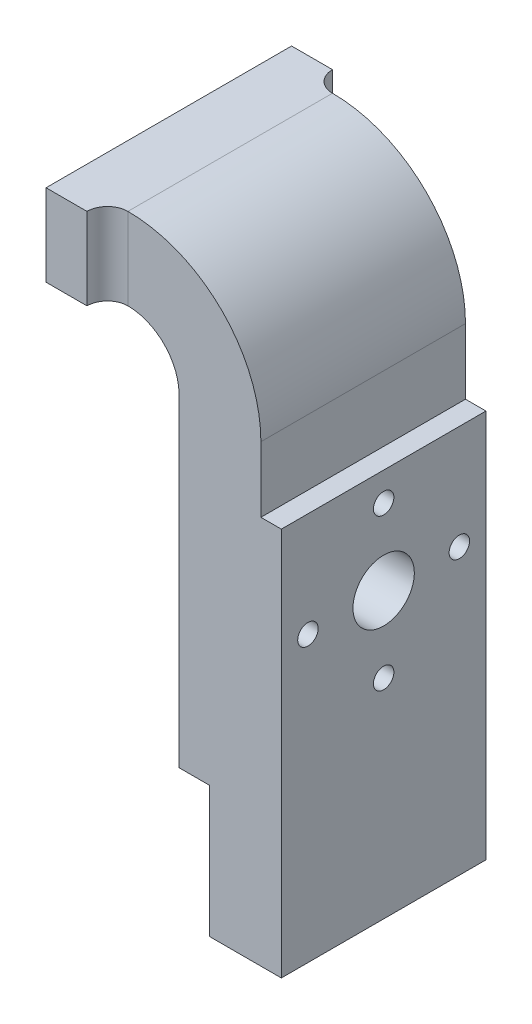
ISO-10303-21;
HEADER;
FILE_DESCRIPTION(('STEP AP214'),'2;1');
FILE_NAME('part.step','',(''),(''),'','','');
FILE_SCHEMA(('AUTOMOTIVE_DESIGN { 1 0 10303 214 1 1 1 1 }'));
ENDSEC;
DATA;
#1=APPLICATION_CONTEXT('core data for automotive mechanical design processes');
#2=APPLICATION_PROTOCOL_DEFINITION('international standard','automotive_design',2000,#1);
#3=PRODUCT_CONTEXT('',#1,'mechanical');
#4=PRODUCT('Part','Part','',(#3));
#5=PRODUCT_RELATED_PRODUCT_CATEGORY('part','',(#4));
#6=PRODUCT_DEFINITION_FORMATION('','',#4);
#7=PRODUCT_DEFINITION_CONTEXT('part definition',#1,'design');
#8=PRODUCT_DEFINITION('design','',#6,#7);
#9=PRODUCT_DEFINITION_SHAPE('','',#8);
#10=(LENGTH_UNIT() NAMED_UNIT(*) SI_UNIT(.MILLI.,.METRE.));
#11=(NAMED_UNIT(*) PLANE_ANGLE_UNIT() SI_UNIT($,.RADIAN.));
#12=(NAMED_UNIT(*) SI_UNIT($,.STERADIAN.) SOLID_ANGLE_UNIT());
#13=UNCERTAINTY_MEASURE_WITH_UNIT(LENGTH_MEASURE(1.E-05),#10,'distance_accuracy_value','');
#14=(GEOMETRIC_REPRESENTATION_CONTEXT(3) GLOBAL_UNCERTAINTY_ASSIGNED_CONTEXT((#13)) GLOBAL_UNIT_ASSIGNED_CONTEXT((#10,
#11,#12)) REPRESENTATION_CONTEXT('',''));
#15=CARTESIAN_POINT('',(0.,0.,0.));
#16=DIRECTION('',(0.,0.,1.));
#17=DIRECTION('',(1.,0.,0.));
#18=AXIS2_PLACEMENT_3D('',#15,#16,#17);
#19=CARTESIAN_POINT('',(107.5,222.,50.));
#20=DIRECTION('',(0.,0.,-1.));
#21=DIRECTION('',(-1.,0.,0.));
#22=AXIS2_PLACEMENT_3D('',#19,#20,#21);
#23=CYLINDRICAL_SURFACE('',#22,25.);
#24=CARTESIAN_POINT('',(107.5,222.,-50.));
#25=DIRECTION('',(0.,0.,-1.));
#26=DIRECTION('',(1.,0.,0.));
#27=AXIS2_PLACEMENT_3D('',#24,#25,#26);
#28=CIRCLE('',#27,25.);
#29=CARTESIAN_POINT('',(107.5,247.,-50.));
#30=VERTEX_POINT('',#29);
#31=CARTESIAN_POINT('',(132.5,222.,-50.));
#32=VERTEX_POINT('',#31);
#33=EDGE_CURVE('E160',#30,#32,#28,.T.);
#34=ORIENTED_EDGE('',*,*,#33,.T.);
#35=DIRECTION('',(0.,0.,-1.));
#36=VECTOR('',#35,1.);
#37=CARTESIAN_POINT('',(132.5,222.,50.));
#38=LINE('',#37,#36);
#39=CARTESIAN_POINT('',(132.5,222.,50.));
#40=VERTEX_POINT('',#39);
#41=EDGE_CURVE('E202',#40,#32,#38,.T.);
#42=ORIENTED_EDGE('',*,*,#41,.F.);
#43=CARTESIAN_POINT('',(107.5,222.,50.));
#44=DIRECTION('',(0.,0.,-1.));
#45=DIRECTION('',(1.,0.,0.));
#46=AXIS2_PLACEMENT_3D('',#43,#44,#45);
#47=CIRCLE('',#46,25.);
#48=CARTESIAN_POINT('',(107.5,247.,50.));
#49=VERTEX_POINT('',#48);
#50=EDGE_CURVE('E178',#49,#40,#47,.T.);
#51=ORIENTED_EDGE('',*,*,#50,.F.);
#52=DIRECTION('',(0.,0.,-1.));
#53=VECTOR('',#52,1.);
#54=CARTESIAN_POINT('',(107.5,247.,50.));
#55=LINE('',#54,#53);
#56=EDGE_CURVE('E154',#49,#30,#55,.T.);
#57=ORIENTED_EDGE('',*,*,#56,.T.);
#58=EDGE_LOOP('',(#34,#42,#51,#57));
#59=FACE_BOUND('',#58,.T.);
#60=ADVANCED_FACE('F38',(#59),#23,.F.);
#61=CARTESIAN_POINT('',(132.5,222.,50.));
#62=DIRECTION('',(1.,0.,0.));
#63=DIRECTION('',(0.,0.,-1.));
#64=AXIS2_PLACEMENT_3D('',#61,#62,#63);
#65=PLANE('',#64);
#66=CARTESIAN_POINT('',(132.5,139.,-37.));
#67=DIRECTION('',(1.,0.,0.));
#68=DIRECTION('',(0.,0.,-1.));
#69=AXIS2_PLACEMENT_3D('',#66,#67,#68);
#70=CIRCLE('',#69,5.);
#71=CARTESIAN_POINT('',(132.5,144.,-37.));
#72=VERTEX_POINT('',#71);
#73=EDGE_CURVE('E499',#72,#72,#70,.T.);
#74=ORIENTED_EDGE('',*,*,#73,.T.);
#75=EDGE_LOOP('',(#74));
#76=FACE_BOUND('',#75,.T.);
#77=CARTESIAN_POINT('',(132.5,176.,0.));
#78=DIRECTION('',(1.,0.,0.));
#79=DIRECTION('',(0.,0.,-1.));
#80=AXIS2_PLACEMENT_3D('',#77,#78,#79);
#81=CIRCLE('',#80,5.);
#82=CARTESIAN_POINT('',(132.5,181.,0.));
#83=VERTEX_POINT('',#82);
#84=EDGE_CURVE('E503',#83,#83,#81,.T.);
#85=ORIENTED_EDGE('',*,*,#84,.T.);
#86=EDGE_LOOP('',(#85));
#87=FACE_BOUND('',#86,.T.);
#88=CARTESIAN_POINT('',(132.5,139.,37.));
#89=DIRECTION('',(1.,0.,0.));
#90=DIRECTION('',(0.,0.,-1.));
#91=AXIS2_PLACEMENT_3D('',#88,#89,#90);
#92=CIRCLE('',#91,5.);
#93=CARTESIAN_POINT('',(132.5,144.,37.));
#94=VERTEX_POINT('',#93);
#95=EDGE_CURVE('E512',#94,#94,#92,.T.);
#96=ORIENTED_EDGE('',*,*,#95,.T.);
#97=EDGE_LOOP('',(#96));
#98=FACE_BOUND('',#97,.T.);
#99=CARTESIAN_POINT('',(132.5,102.,0.));
#100=DIRECTION('',(1.,0.,0.));
#101=DIRECTION('',(0.,0.,-1.));
#102=AXIS2_PLACEMENT_3D('',#99,#100,#101);
#103=CIRCLE('',#102,5.);
#104=CARTESIAN_POINT('',(132.5,107.,0.));
#105=VERTEX_POINT('',#104);
#106=EDGE_CURVE('E518',#105,#105,#103,.T.);
#107=ORIENTED_EDGE('',*,*,#106,.T.);
#108=EDGE_LOOP('',(#107));
#109=FACE_BOUND('',#108,.T.);
#110=CARTESIAN_POINT('',(132.5,139.,0.));
#111=DIRECTION('',(1.,0.,0.));
#112=DIRECTION('',(0.,0.,-1.));
#113=AXIS2_PLACEMENT_3D('',#110,#111,#112);
#114=CIRCLE('',#113,15.);
#115=CARTESIAN_POINT('',(132.5,139.,-15.));
#116=VERTEX_POINT('',#115);
#117=EDGE_CURVE('E524',#116,#116,#114,.T.);
#118=ORIENTED_EDGE('',*,*,#117,.T.);
#119=EDGE_LOOP('',(#118));
#120=FACE_BOUND('',#119,.T.);
#121=DIRECTION('',(0.,-1.,0.));
#122=VECTOR('',#121,1.);
#123=CARTESIAN_POINT('',(132.5,222.,-50.));
#124=LINE('',#123,#122);
#125=CARTESIAN_POINT('',(132.5,64.,-50.));
#126=VERTEX_POINT('',#125);
#127=EDGE_CURVE('E163',#32,#126,#124,.T.);
#128=ORIENTED_EDGE('',*,*,#127,.T.);
#129=DIRECTION('',(0.,0.,-1.));
#130=VECTOR('',#129,1.);
#131=CARTESIAN_POINT('',(132.5,64.,50.));
#132=LINE('',#131,#130);
#133=CARTESIAN_POINT('',(132.5,64.,50.));
#134=VERTEX_POINT('',#133);
#135=EDGE_CURVE('E199',#134,#126,#132,.T.);
#136=ORIENTED_EDGE('',*,*,#135,.F.);
#137=DIRECTION('',(0.,-1.,0.));
#138=VECTOR('',#137,1.);
#139=CARTESIAN_POINT('',(132.5,222.,50.));
#140=LINE('',#139,#138);
#141=EDGE_CURVE('E108',#40,#134,#140,.T.);
#142=ORIENTED_EDGE('',*,*,#141,.F.);
#143=ORIENTED_EDGE('',*,*,#41,.T.);
#144=EDGE_LOOP('',(#128,#136,#142,#143));
#145=FACE_BOUND('',#144,.T.);
#146=ADVANCED_FACE('F280',(#76,#87,#98,#109,#120,#145),#65,.F.);
#147=CARTESIAN_POINT('',(132.5,64.,50.));
#148=DIRECTION('',(0.,1.,0.));
#149=DIRECTION('',(0.,0.,1.));
#150=AXIS2_PLACEMENT_3D('',#147,#148,#149);
#151=PLANE('',#150);
#152=DIRECTION('',(1.,0.,0.));
#153=VECTOR('',#152,1.);
#154=CARTESIAN_POINT('',(132.5,64.,-50.));
#155=LINE('',#154,#153);
#156=CARTESIAN_POINT('',(147.5,64.,-50.));
#157=VERTEX_POINT('',#156);
#158=EDGE_CURVE('E166',#126,#157,#155,.T.);
#159=ORIENTED_EDGE('',*,*,#158,.T.);
#160=DIRECTION('',(0.,0.,-1.));
#161=VECTOR('',#160,1.);
#162=CARTESIAN_POINT('',(147.5,64.,50.));
#163=LINE('',#162,#161);
#164=CARTESIAN_POINT('',(147.5,64.,50.));
#165=VERTEX_POINT('',#164);
#166=EDGE_CURVE('E196',#165,#157,#163,.T.);
#167=ORIENTED_EDGE('',*,*,#166,.F.);
#168=DIRECTION('',(1.,0.,0.));
#169=VECTOR('',#168,1.);
#170=CARTESIAN_POINT('',(132.5,64.,50.));
#171=LINE('',#170,#169);
#172=EDGE_CURVE('E236',#134,#165,#171,.T.);
#173=ORIENTED_EDGE('',*,*,#172,.F.);
#174=ORIENTED_EDGE('',*,*,#135,.T.);
#175=EDGE_LOOP('',(#159,#167,#173,#174));
#176=FACE_BOUND('',#175,.T.);
#177=ADVANCED_FACE('F283',(#176),#151,.F.);
#178=CARTESIAN_POINT('',(147.5,64.,50.));
#179=DIRECTION('',(1.,0.,0.));
#180=DIRECTION('',(0.,1.,0.));
#181=AXIS2_PLACEMENT_3D('',#178,#179,#180);
#182=PLANE('',#181);
#183=DIRECTION('',(0.,-1.,0.));
#184=VECTOR('',#183,1.);
#185=CARTESIAN_POINT('',(147.5,64.,-50.));
#186=LINE('',#185,#184);
#187=CARTESIAN_POINT('',(147.5,0.,-50.));
#188=VERTEX_POINT('',#187);
#189=EDGE_CURVE('E168',#157,#188,#186,.T.);
#190=ORIENTED_EDGE('',*,*,#189,.T.);
#191=DIRECTION('',(0.,0.,-1.));
#192=VECTOR('',#191,1.);
#193=CARTESIAN_POINT('',(147.5,0.,50.));
#194=LINE('',#193,#192);
#195=CARTESIAN_POINT('',(147.5,0.,50.));
#196=VERTEX_POINT('',#195);
#197=EDGE_CURVE('E193',#196,#188,#194,.T.);
#198=ORIENTED_EDGE('',*,*,#197,.F.);
#199=DIRECTION('',(0.,-1.,0.));
#200=VECTOR('',#199,1.);
#201=CARTESIAN_POINT('',(147.5,64.,50.));
#202=LINE('',#201,#200);
#203=EDGE_CURVE('E238',#165,#196,#202,.T.);
#204=ORIENTED_EDGE('',*,*,#203,.F.);
#205=ORIENTED_EDGE('',*,*,#166,.T.);
#206=EDGE_LOOP('',(#190,#198,#204,#205));
#207=FACE_BOUND('',#206,.T.);
#208=ADVANCED_FACE('F288',(#207),#182,.F.);
#209=CARTESIAN_POINT('',(147.5,0.,50.));
#210=DIRECTION('',(0.,1.,0.));
#211=DIRECTION('',(0.,0.,1.));
#212=AXIS2_PLACEMENT_3D('',#209,#210,#211);
#213=PLANE('',#212);
#214=DIRECTION('',(1.,0.,0.));
#215=VECTOR('',#214,1.);
#216=CARTESIAN_POINT('',(147.5,0.,-50.));
#217=LINE('',#216,#215);
#218=CARTESIAN_POINT('',(182.5,0.,-50.));
#219=VERTEX_POINT('',#218);
#220=EDGE_CURVE('E170',#188,#219,#217,.T.);
#221=ORIENTED_EDGE('',*,*,#220,.T.);
#222=DIRECTION('',(0.,0.,-1.));
#223=VECTOR('',#222,1.);
#224=CARTESIAN_POINT('',(182.5,0.,50.));
#225=LINE('',#224,#223);
#226=CARTESIAN_POINT('',(182.5,0.,50.));
#227=VERTEX_POINT('',#226);
#228=EDGE_CURVE('E190',#227,#219,#225,.T.);
#229=ORIENTED_EDGE('',*,*,#228,.F.);
#230=DIRECTION('',(1.,0.,0.));
#231=VECTOR('',#230,1.);
#232=CARTESIAN_POINT('',(147.5,0.,50.));
#233=LINE('',#232,#231);
#234=EDGE_CURVE('E240',#196,#227,#233,.T.);
#235=ORIENTED_EDGE('',*,*,#234,.F.);
#236=ORIENTED_EDGE('',*,*,#197,.T.);
#237=EDGE_LOOP('',(#221,#229,#235,#236));
#238=FACE_BOUND('',#237,.T.);
#239=ADVANCED_FACE('F291',(#238),#213,.F.);
#240=CARTESIAN_POINT('',(182.5,190.,50.));
#241=DIRECTION('',(-1.,0.,0.));
#242=DIRECTION('',(0.,-1.,0.));
#243=AXIS2_PLACEMENT_3D('',#240,#241,#242);
#244=PLANE('',#243);
#245=CARTESIAN_POINT('',(182.5,139.,-37.));
#246=DIRECTION('',(1.,0.,0.));
#247=DIRECTION('',(0.,1.,0.));
#248=AXIS2_PLACEMENT_3D('',#245,#246,#247);
#249=CIRCLE('',#248,5.);
#250=CARTESIAN_POINT('',(182.5,144.,-37.));
#251=VERTEX_POINT('',#250);
#252=EDGE_CURVE('E496',#251,#251,#249,.T.);
#253=ORIENTED_EDGE('',*,*,#252,.F.);
#254=EDGE_LOOP('',(#253));
#255=FACE_BOUND('',#254,.T.);
#256=CARTESIAN_POINT('',(182.5,176.,0.));
#257=DIRECTION('',(1.,0.,0.));
#258=DIRECTION('',(0.,1.,0.));
#259=AXIS2_PLACEMENT_3D('',#256,#257,#258);
#260=CIRCLE('',#259,5.);
#261=CARTESIAN_POINT('',(182.5,181.,0.));
#262=VERTEX_POINT('',#261);
#263=EDGE_CURVE('E500',#262,#262,#260,.T.);
#264=ORIENTED_EDGE('',*,*,#263,.F.);
#265=EDGE_LOOP('',(#264));
#266=FACE_BOUND('',#265,.T.);
#267=CARTESIAN_POINT('',(182.5,139.,37.));
#268=DIRECTION('',(1.,0.,0.));
#269=DIRECTION('',(0.,1.,0.));
#270=AXIS2_PLACEMENT_3D('',#267,#268,#269);
#271=CIRCLE('',#270,5.);
#272=CARTESIAN_POINT('',(182.5,144.,37.));
#273=VERTEX_POINT('',#272);
#274=EDGE_CURVE('E509',#273,#273,#271,.T.);
#275=ORIENTED_EDGE('',*,*,#274,.F.);
#276=EDGE_LOOP('',(#275));
#277=FACE_BOUND('',#276,.T.);
#278=CARTESIAN_POINT('',(182.5,102.,0.));
#279=DIRECTION('',(1.,0.,0.));
#280=DIRECTION('',(0.,1.,0.));
#281=AXIS2_PLACEMENT_3D('',#278,#279,#280);
#282=CIRCLE('',#281,5.);
#283=CARTESIAN_POINT('',(182.5,107.,0.));
#284=VERTEX_POINT('',#283);
#285=EDGE_CURVE('E515',#284,#284,#282,.T.);
#286=ORIENTED_EDGE('',*,*,#285,.F.);
#287=EDGE_LOOP('',(#286));
#288=FACE_BOUND('',#287,.T.);
#289=CARTESIAN_POINT('',(182.5,139.,0.));
#290=DIRECTION('',(1.,0.,0.));
#291=DIRECTION('',(0.,1.,0.));
#292=AXIS2_PLACEMENT_3D('',#289,#290,#291);
#293=CIRCLE('',#292,15.);
#294=CARTESIAN_POINT('',(182.5,154.,0.));
#295=VERTEX_POINT('',#294);
#296=EDGE_CURVE('E521',#295,#295,#293,.T.);
#297=ORIENTED_EDGE('',*,*,#296,.F.);
#298=EDGE_LOOP('',(#297));
#299=FACE_BOUND('',#298,.T.);
#300=DIRECTION('',(0.,1.,0.));
#301=VECTOR('',#300,1.);
#302=CARTESIAN_POINT('',(182.5,190.,-50.));
#303=LINE('',#302,#301);
#304=CARTESIAN_POINT('',(182.5,190.,-50.));
#305=VERTEX_POINT('',#304);
#306=EDGE_CURVE('E172',#219,#305,#303,.T.);
#307=ORIENTED_EDGE('',*,*,#306,.T.);
#308=DIRECTION('',(0.,0.,-1.));
#309=VECTOR('',#308,1.);
#310=CARTESIAN_POINT('',(182.5,190.,50.));
#311=LINE('',#310,#309);
#312=CARTESIAN_POINT('',(182.5,190.,50.));
#313=VERTEX_POINT('',#312);
#314=EDGE_CURVE('E187',#313,#305,#311,.T.);
#315=ORIENTED_EDGE('',*,*,#314,.F.);
#316=DIRECTION('',(0.,1.,0.));
#317=VECTOR('',#316,1.);
#318=CARTESIAN_POINT('',(182.5,190.,50.));
#319=LINE('',#318,#317);
#320=EDGE_CURVE('E242',#227,#313,#319,.T.);
#321=ORIENTED_EDGE('',*,*,#320,.F.);
#322=ORIENTED_EDGE('',*,*,#228,.T.);
#323=EDGE_LOOP('',(#307,#315,#321,#322));
#324=FACE_BOUND('',#323,.T.);
#325=ADVANCED_FACE('F248',(#255,#266,#277,#288,#299,#324),#244,.F.);
#326=CARTESIAN_POINT('',(172.5,190.,50.));
#327=DIRECTION('',(0.,-1.,0.));
#328=DIRECTION('',(0.,0.,-1.));
#329=AXIS2_PLACEMENT_3D('',#326,#327,#328);
#330=PLANE('',#329);
#331=DIRECTION('',(-1.,0.,0.));
#332=VECTOR('',#331,1.);
#333=CARTESIAN_POINT('',(172.5,190.,-50.));
#334=LINE('',#333,#332);
#335=CARTESIAN_POINT('',(172.5,190.,-50.));
#336=VERTEX_POINT('',#335);
#337=EDGE_CURVE('E174',#305,#336,#334,.T.);
#338=ORIENTED_EDGE('',*,*,#337,.T.);
#339=DIRECTION('',(0.,0.,-1.));
#340=VECTOR('',#339,1.);
#341=CARTESIAN_POINT('',(172.5,190.,50.));
#342=LINE('',#341,#340);
#343=CARTESIAN_POINT('',(172.5,190.,50.));
#344=VERTEX_POINT('',#343);
#345=EDGE_CURVE('E149',#344,#336,#342,.T.);
#346=ORIENTED_EDGE('',*,*,#345,.F.);
#347=DIRECTION('',(-1.,0.,0.));
#348=VECTOR('',#347,1.);
#349=CARTESIAN_POINT('',(172.5,190.,50.));
#350=LINE('',#349,#348);
#351=EDGE_CURVE('E136',#313,#344,#350,.T.);
#352=ORIENTED_EDGE('',*,*,#351,.F.);
#353=ORIENTED_EDGE('',*,*,#314,.T.);
#354=EDGE_LOOP('',(#338,#346,#352,#353));
#355=FACE_BOUND('',#354,.T.);
#356=ADVANCED_FACE('F252',(#355),#330,.F.);
#357=CARTESIAN_POINT('',(172.5,222.,50.));
#358=DIRECTION('',(-1.,0.,0.));
#359=DIRECTION('',(0.,-1.,0.));
#360=AXIS2_PLACEMENT_3D('',#357,#358,#359);
#361=PLANE('',#360);
#362=DIRECTION('',(0.,1.,0.));
#363=VECTOR('',#362,1.);
#364=CARTESIAN_POINT('',(172.5,222.,-50.));
#365=LINE('',#364,#363);
#366=CARTESIAN_POINT('',(172.5,222.,-50.));
#367=VERTEX_POINT('',#366);
#368=EDGE_CURVE('E145',#336,#367,#365,.T.);
#369=ORIENTED_EDGE('',*,*,#368,.T.);
#370=DIRECTION('',(0.,0.,-1.));
#371=VECTOR('',#370,1.);
#372=CARTESIAN_POINT('',(172.5,222.,50.));
#373=LINE('',#372,#371);
#374=CARTESIAN_POINT('',(172.5,222.,50.));
#375=VERTEX_POINT('',#374);
#376=EDGE_CURVE('E142',#375,#367,#373,.T.);
#377=ORIENTED_EDGE('',*,*,#376,.F.);
#378=DIRECTION('',(0.,1.,0.));
#379=VECTOR('',#378,1.);
#380=CARTESIAN_POINT('',(172.5,222.,50.));
#381=LINE('',#380,#379);
#382=EDGE_CURVE('E129',#344,#375,#381,.T.);
#383=ORIENTED_EDGE('',*,*,#382,.F.);
#384=ORIENTED_EDGE('',*,*,#345,.T.);
#385=EDGE_LOOP('',(#369,#377,#383,#384));
#386=FACE_BOUND('',#385,.T.);
#387=ADVANCED_FACE('F143',(#386),#361,.F.);
#388=CARTESIAN_POINT('',(107.5,222.,50.));
#389=DIRECTION('',(0.,0.,-1.));
#390=DIRECTION('',(-1.,0.,0.));
#391=AXIS2_PLACEMENT_3D('',#388,#389,#390);
#392=CYLINDRICAL_SURFACE('',#391,65.);
#393=CARTESIAN_POINT('',(107.5,222.,-50.));
#394=DIRECTION('',(0.,0.,1.));
#395=DIRECTION('',(1.,0.,0.));
#396=AXIS2_PLACEMENT_3D('',#393,#394,#395);
#397=CIRCLE('',#396,65.);
#398=CARTESIAN_POINT('',(107.5,287.,-50.));
#399=VERTEX_POINT('',#398);
#400=EDGE_CURVE('E177',#367,#399,#397,.T.);
#401=ORIENTED_EDGE('',*,*,#400,.T.);
#402=DIRECTION('',(0.,0.,-1.));
#403=VECTOR('',#402,1.);
#404=CARTESIAN_POINT('',(107.5,287.,50.));
#405=LINE('',#404,#403);
#406=CARTESIAN_POINT('',(107.5,287.,50.));
#407=VERTEX_POINT('',#406);
#408=EDGE_CURVE('E150',#407,#399,#405,.T.);
#409=ORIENTED_EDGE('',*,*,#408,.F.);
#410=CARTESIAN_POINT('',(107.5,222.,50.));
#411=DIRECTION('',(0.,0.,1.));
#412=DIRECTION('',(1.,0.,0.));
#413=AXIS2_PLACEMENT_3D('',#410,#411,#412);
#414=CIRCLE('',#413,65.);
#415=EDGE_CURVE('E133',#375,#407,#414,.T.);
#416=ORIENTED_EDGE('',*,*,#415,.F.);
#417=ORIENTED_EDGE('',*,*,#376,.T.);
#418=EDGE_LOOP('',(#401,#409,#416,#417));
#419=FACE_BOUND('',#418,.T.);
#420=ADVANCED_FACE('F152',(#419),#392,.T.);
#421=CARTESIAN_POINT('',(107.5,287.,50.));
#422=DIRECTION('',(0.,-1.,0.));
#423=DIRECTION('',(0.,0.,-1.));
#424=AXIS2_PLACEMENT_3D('',#421,#422,#423);
#425=PLANE('',#424);
#426=ORIENTED_EDGE('',*,*,#408,.T.);
#427=CARTESIAN_POINT('',(107.5,287.,-60.));
#428=DIRECTION('',(0.,-1.,0.));
#429=DIRECTION('',(0.,0.,-1.));
#430=AXIS2_PLACEMENT_3D('',#427,#428,#429);
#431=CIRCLE('',#430,10.);
#432=CARTESIAN_POINT('',(97.5,287.,-60.));
#433=VERTEX_POINT('',#432);
#434=EDGE_CURVE('E92',#399,#433,#431,.T.);
#435=ORIENTED_EDGE('',*,*,#434,.T.);
#436=DIRECTION('',(-1.,0.,0.));
#437=VECTOR('',#436,1.);
#438=CARTESIAN_POINT('',(77.5,287.,-60.));
#439=LINE('',#438,#437);
#440=CARTESIAN_POINT('',(77.5,287.,-60.));
#441=VERTEX_POINT('',#440);
#442=EDGE_CURVE('E542',#433,#441,#439,.T.);
#443=ORIENTED_EDGE('',*,*,#442,.T.);
#444=DIRECTION('',(0.,0.,-1.));
#445=VECTOR('',#444,1.);
#446=CARTESIAN_POINT('',(77.5,287.,50.));
#447=LINE('',#446,#445);
#448=CARTESIAN_POINT('',(77.5,287.,60.));
#449=VERTEX_POINT('',#448);
#450=EDGE_CURVE('E182',#449,#441,#447,.T.);
#451=ORIENTED_EDGE('',*,*,#450,.F.);
#452=DIRECTION('',(-1.,0.,0.));
#453=VECTOR('',#452,1.);
#454=CARTESIAN_POINT('',(77.5,287.,60.));
#455=LINE('',#454,#453);
#456=CARTESIAN_POINT('',(97.5,287.,60.));
#457=VERTEX_POINT('',#456);
#458=EDGE_CURVE('E164',#457,#449,#455,.T.);
#459=ORIENTED_EDGE('',*,*,#458,.F.);
#460=CARTESIAN_POINT('',(107.5,287.,60.));
#461=DIRECTION('',(0.,-1.,0.));
#462=DIRECTION('',(0.,0.,-1.));
#463=AXIS2_PLACEMENT_3D('',#460,#461,#462);
#464=CIRCLE('',#463,10.);
#465=EDGE_CURVE('E47',#457,#407,#464,.T.);
#466=ORIENTED_EDGE('',*,*,#465,.T.);
#467=EDGE_LOOP('',(#426,#435,#443,#451,#459,#466));
#468=FACE_BOUND('',#467,.T.);
#469=ADVANCED_FACE('F211',(#468),#425,.F.);
#470=CARTESIAN_POINT('',(77.5,287.,50.));
#471=DIRECTION('',(1.,0.,0.));
#472=DIRECTION('',(0.,0.,-1.));
#473=AXIS2_PLACEMENT_3D('',#470,#471,#472);
#474=PLANE('',#473);
#475=CARTESIAN_POINT('',(77.5,267.,-35.));
#476=DIRECTION('',(-1.,0.,0.));
#477=DIRECTION('',(0.,0.,1.));
#478=AXIS2_PLACEMENT_3D('',#475,#476,#477);
#479=CIRCLE('',#478,5.24999999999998);
#480=CARTESIAN_POINT('',(77.5,267.,-29.75));
#481=VERTEX_POINT('',#480);
#482=EDGE_CURVE('E527',#481,#481,#479,.T.);
#483=ORIENTED_EDGE('',*,*,#482,.F.);
#484=EDGE_LOOP('',(#483));
#485=FACE_BOUND('',#484,.T.);
#486=CARTESIAN_POINT('',(77.5,267.,35.));
#487=DIRECTION('',(-1.,0.,0.));
#488=DIRECTION('',(0.,0.,1.));
#489=AXIS2_PLACEMENT_3D('',#486,#487,#488);
#490=CIRCLE('',#489,5.24999999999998);
#491=CARTESIAN_POINT('',(77.5,267.,40.25));
#492=VERTEX_POINT('',#491);
#493=EDGE_CURVE('E533',#492,#492,#490,.T.);
#494=ORIENTED_EDGE('',*,*,#493,.F.);
#495=EDGE_LOOP('',(#494));
#496=FACE_BOUND('',#495,.T.);
#497=ORIENTED_EDGE('',*,*,#450,.T.);
#498=DIRECTION('',(0.,-1.,0.));
#499=VECTOR('',#498,1.);
#500=CARTESIAN_POINT('',(77.5,287.,-60.));
#501=LINE('',#500,#499);
#502=CARTESIAN_POINT('',(77.5,247.,-60.));
#503=VERTEX_POINT('',#502);
#504=EDGE_CURVE('E539',#441,#503,#501,.T.);
#505=ORIENTED_EDGE('',*,*,#504,.T.);
#506=DIRECTION('',(0.,0.,-1.));
#507=VECTOR('',#506,1.);
#508=CARTESIAN_POINT('',(77.5,247.,50.));
#509=LINE('',#508,#507);
#510=CARTESIAN_POINT('',(77.5,247.,60.));
#511=VERTEX_POINT('',#510);
#512=EDGE_CURVE('E156',#511,#503,#509,.T.);
#513=ORIENTED_EDGE('',*,*,#512,.F.);
#514=DIRECTION('',(0.,-1.,0.));
#515=VECTOR('',#514,1.);
#516=CARTESIAN_POINT('',(77.5,287.,60.));
#517=LINE('',#516,#515);
#518=EDGE_CURVE('E230',#449,#511,#517,.T.);
#519=ORIENTED_EDGE('',*,*,#518,.F.);
#520=EDGE_LOOP('',(#497,#505,#513,#519));
#521=FACE_BOUND('',#520,.T.);
#522=ADVANCED_FACE('F331',(#485,#496,#521),#474,.F.);
#523=CARTESIAN_POINT('',(77.5,247.,50.));
#524=DIRECTION('',(0.,1.,0.));
#525=DIRECTION('',(0.,0.,1.));
#526=AXIS2_PLACEMENT_3D('',#523,#524,#525);
#527=PLANE('',#526);
#528=ORIENTED_EDGE('',*,*,#512,.T.);
#529=DIRECTION('',(1.,0.,0.));
#530=VECTOR('',#529,1.);
#531=CARTESIAN_POINT('',(77.5,247.,-60.));
#532=LINE('',#531,#530);
#533=CARTESIAN_POINT('',(97.5,247.,-60.));
#534=VERTEX_POINT('',#533);
#535=EDGE_CURVE('E546',#503,#534,#532,.T.);
#536=ORIENTED_EDGE('',*,*,#535,.T.);
#537=CARTESIAN_POINT('',(107.5,247.,-60.));
#538=DIRECTION('',(0.,1.,0.));
#539=DIRECTION('',(0.,0.,1.));
#540=AXIS2_PLACEMENT_3D('',#537,#538,#539);
#541=CIRCLE('',#540,10.);
#542=EDGE_CURVE('E99',#534,#30,#541,.T.);
#543=ORIENTED_EDGE('',*,*,#542,.T.);
#544=ORIENTED_EDGE('',*,*,#56,.F.);
#545=CARTESIAN_POINT('',(107.5,247.,60.));
#546=DIRECTION('',(0.,1.,0.));
#547=DIRECTION('',(0.,0.,1.));
#548=AXIS2_PLACEMENT_3D('',#545,#546,#547);
#549=CIRCLE('',#548,10.);
#550=CARTESIAN_POINT('',(97.5,247.,60.));
#551=VERTEX_POINT('',#550);
#552=EDGE_CURVE('E11',#49,#551,#549,.T.);
#553=ORIENTED_EDGE('',*,*,#552,.T.);
#554=DIRECTION('',(1.,0.,0.));
#555=VECTOR('',#554,1.);
#556=CARTESIAN_POINT('',(77.5,247.,60.));
#557=LINE('',#556,#555);
#558=EDGE_CURVE('E227',#511,#551,#557,.T.);
#559=ORIENTED_EDGE('',*,*,#558,.F.);
#560=EDGE_LOOP('',(#528,#536,#543,#544,#553,#559));
#561=FACE_BOUND('',#560,.T.);
#562=ADVANCED_FACE('F274',(#561),#527,.F.);
#563=CARTESIAN_POINT('',(107.5,222.,50.));
#564=DIRECTION('',(0.,0.,1.));
#565=DIRECTION('',(1.,0.,0.));
#566=AXIS2_PLACEMENT_3D('',#563,#564,#565);
#567=PLANE('',#566);
#568=ORIENTED_EDGE('',*,*,#415,.T.);
#569=DIRECTION('',(0.,1.,0.));
#570=VECTOR('',#569,1.);
#571=CARTESIAN_POINT('',(107.5,222.,50.));
#572=LINE('',#571,#570);
#573=EDGE_CURVE('E55',#407,#49,#572,.F.);
#574=ORIENTED_EDGE('',*,*,#573,.T.);
#575=ORIENTED_EDGE('',*,*,#50,.T.);
#576=ORIENTED_EDGE('',*,*,#141,.T.);
#577=ORIENTED_EDGE('',*,*,#172,.T.);
#578=ORIENTED_EDGE('',*,*,#203,.T.);
#579=ORIENTED_EDGE('',*,*,#234,.T.);
#580=ORIENTED_EDGE('',*,*,#320,.T.);
#581=ORIENTED_EDGE('',*,*,#351,.T.);
#582=ORIENTED_EDGE('',*,*,#382,.T.);
#583=EDGE_LOOP('',(#568,#574,#575,#576,#577,#578,#579,#580,#581,#582));
#584=FACE_BOUND('',#583,.T.);
#585=ADVANCED_FACE('F131',(#584),#567,.T.);
#586=CARTESIAN_POINT('',(107.5,222.,-50.));
#587=DIRECTION('',(0.,0.,1.));
#588=DIRECTION('',(1.,0.,0.));
#589=AXIS2_PLACEMENT_3D('',#586,#587,#588);
#590=PLANE('',#589);
#591=ORIENTED_EDGE('',*,*,#33,.F.);
#592=DIRECTION('',(0.,1.,0.));
#593=VECTOR('',#592,1.);
#594=CARTESIAN_POINT('',(107.5,222.,-50.));
#595=LINE('',#594,#593);
#596=EDGE_CURVE('E204',#30,#399,#595,.T.);
#597=ORIENTED_EDGE('',*,*,#596,.T.);
#598=ORIENTED_EDGE('',*,*,#400,.F.);
#599=ORIENTED_EDGE('',*,*,#368,.F.);
#600=ORIENTED_EDGE('',*,*,#337,.F.);
#601=ORIENTED_EDGE('',*,*,#306,.F.);
#602=ORIENTED_EDGE('',*,*,#220,.F.);
#603=ORIENTED_EDGE('',*,*,#189,.F.);
#604=ORIENTED_EDGE('',*,*,#158,.F.);
#605=ORIENTED_EDGE('',*,*,#127,.F.);
#606=EDGE_LOOP('',(#591,#597,#598,#599,#600,#601,#602,#603,#604,#605));
#607=FACE_BOUND('',#606,.T.);
#608=ADVANCED_FACE('F255',(#607),#590,.F.);
#609=CARTESIAN_POINT('',(0.,0.,60.));
#610=DIRECTION('',(0.,0.,1.));
#611=DIRECTION('',(1.,0.,0.));
#612=AXIS2_PLACEMENT_3D('',#609,#610,#611);
#613=PLANE('',#612);
#614=ORIENTED_EDGE('',*,*,#518,.T.);
#615=ORIENTED_EDGE('',*,*,#558,.T.);
#616=DIRECTION('',(0.,1.,0.));
#617=VECTOR('',#616,1.);
#618=CARTESIAN_POINT('',(97.5,287.,60.));
#619=LINE('',#618,#617);
#620=EDGE_CURVE('E220',#551,#457,#619,.T.);
#621=ORIENTED_EDGE('',*,*,#620,.T.);
#622=ORIENTED_EDGE('',*,*,#458,.T.);
#623=EDGE_LOOP('',(#614,#615,#621,#622));
#624=FACE_BOUND('',#623,.T.);
#625=ADVANCED_FACE('F224',(#624),#613,.T.);
#626=CARTESIAN_POINT('',(0.,0.,-60.));
#627=DIRECTION('',(0.,0.,-1.));
#628=DIRECTION('',(1.,0.,0.));
#629=AXIS2_PLACEMENT_3D('',#626,#627,#628);
#630=PLANE('',#629);
#631=ORIENTED_EDGE('',*,*,#504,.F.);
#632=ORIENTED_EDGE('',*,*,#442,.F.);
#633=DIRECTION('',(0.,1.,0.));
#634=VECTOR('',#633,1.);
#635=CARTESIAN_POINT('',(97.5,287.,-60.));
#636=LINE('',#635,#634);
#637=EDGE_CURVE('E260',#534,#433,#636,.T.);
#638=ORIENTED_EDGE('',*,*,#637,.F.);
#639=ORIENTED_EDGE('',*,*,#535,.F.);
#640=EDGE_LOOP('',(#631,#632,#638,#639));
#641=FACE_BOUND('',#640,.T.);
#642=ADVANCED_FACE('F310',(#641),#630,.T.);
#643=CARTESIAN_POINT('',(107.5,222.,-60.));
#644=DIRECTION('',(0.,1.,0.));
#645=DIRECTION('',(0.,0.,1.));
#646=AXIS2_PLACEMENT_3D('',#643,#644,#645);
#647=CYLINDRICAL_SURFACE('',#646,10.);
#648=ORIENTED_EDGE('',*,*,#542,.F.);
#649=ORIENTED_EDGE('',*,*,#637,.T.);
#650=ORIENTED_EDGE('',*,*,#434,.F.);
#651=ORIENTED_EDGE('',*,*,#596,.F.);
#652=EDGE_LOOP('',(#648,#649,#650,#651));
#653=FACE_BOUND('',#652,.T.);
#654=ADVANCED_FACE('F256',(#653),#647,.F.);
#655=CARTESIAN_POINT('',(107.5,287.,60.));
#656=DIRECTION('',(0.,1.,0.));
#657=DIRECTION('',(0.,0.,1.));
#658=AXIS2_PLACEMENT_3D('',#655,#656,#657);
#659=CYLINDRICAL_SURFACE('',#658,10.);
#660=ORIENTED_EDGE('',*,*,#552,.F.);
#661=ORIENTED_EDGE('',*,*,#573,.F.);
#662=ORIENTED_EDGE('',*,*,#465,.F.);
#663=ORIENTED_EDGE('',*,*,#620,.F.);
#664=EDGE_LOOP('',(#660,#661,#662,#663));
#665=FACE_BOUND('',#664,.T.);
#666=ADVANCED_FACE('F40',(#665),#659,.F.);
#667=CARTESIAN_POINT('',(106.,267.,35.));
#668=DIRECTION('',(-1.,0.,0.));
#669=DIRECTION('',(0.,0.,1.));
#670=AXIS2_PLACEMENT_3D('',#667,#668,#669);
#671=CONICAL_SURFACE('',#670,5.24999999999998,1.02974425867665);
#672=CARTESIAN_POINT('',(109.154518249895,267.,35.));
#673=VERTEX_POINT('',#672);
#674=VERTEX_LOOP('',#673);
#675=FACE_BOUND('',#674,.T.);
#676=CARTESIAN_POINT('',(106.,267.,35.));
#677=DIRECTION('',(-1.,0.,0.));
#678=DIRECTION('',(0.,0.,1.));
#679=AXIS2_PLACEMENT_3D('',#676,#677,#678);
#680=CIRCLE('',#679,5.24999999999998);
#681=CARTESIAN_POINT('',(106.,267.,40.25));
#682=VERTEX_POINT('',#681);
#683=EDGE_CURVE('E536',#682,#682,#680,.T.);
#684=ORIENTED_EDGE('',*,*,#683,.T.);
#685=EDGE_LOOP('',(#684));
#686=FACE_BOUND('',#685,.T.);
#687=ADVANCED_FACE('F315',(#675,#686),#671,.F.);
#688=CARTESIAN_POINT('',(77.5,267.,35.));
#689=DIRECTION('',(-1.,0.,0.));
#690=DIRECTION('',(0.,0.,1.));
#691=AXIS2_PLACEMENT_3D('',#688,#689,#690);
#692=CYLINDRICAL_SURFACE('',#691,5.24999999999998);
#693=ORIENTED_EDGE('',*,*,#683,.F.);
#694=EDGE_LOOP('',(#693));
#695=FACE_BOUND('',#694,.T.);
#696=ORIENTED_EDGE('',*,*,#493,.T.);
#697=EDGE_LOOP('',(#696));
#698=FACE_BOUND('',#697,.T.);
#699=ADVANCED_FACE('F402',(#695,#698),#692,.F.);
#700=CARTESIAN_POINT('',(106.,267.,-35.));
#701=DIRECTION('',(-1.,0.,0.));
#702=DIRECTION('',(0.,0.,1.));
#703=AXIS2_PLACEMENT_3D('',#700,#701,#702);
#704=CONICAL_SURFACE('',#703,5.24999999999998,1.02974425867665);
#705=CARTESIAN_POINT('',(109.154518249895,267.,-35.));
#706=VERTEX_POINT('',#705);
#707=VERTEX_LOOP('',#706);
#708=FACE_BOUND('',#707,.T.);
#709=CARTESIAN_POINT('',(106.,267.,-35.));
#710=DIRECTION('',(-1.,0.,0.));
#711=DIRECTION('',(0.,0.,1.));
#712=AXIS2_PLACEMENT_3D('',#709,#710,#711);
#713=CIRCLE('',#712,5.24999999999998);
#714=CARTESIAN_POINT('',(106.,267.,-29.75));
#715=VERTEX_POINT('',#714);
#716=EDGE_CURVE('E530',#715,#715,#713,.T.);
#717=ORIENTED_EDGE('',*,*,#716,.T.);
#718=EDGE_LOOP('',(#717));
#719=FACE_BOUND('',#718,.T.);
#720=ADVANCED_FACE('F409',(#708,#719),#704,.F.);
#721=CARTESIAN_POINT('',(77.5,267.,-35.));
#722=DIRECTION('',(-1.,0.,0.));
#723=DIRECTION('',(0.,0.,1.));
#724=AXIS2_PLACEMENT_3D('',#721,#722,#723);
#725=CYLINDRICAL_SURFACE('',#724,5.24999999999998);
#726=ORIENTED_EDGE('',*,*,#716,.F.);
#727=EDGE_LOOP('',(#726));
#728=FACE_BOUND('',#727,.T.);
#729=ORIENTED_EDGE('',*,*,#482,.T.);
#730=EDGE_LOOP('',(#729));
#731=FACE_BOUND('',#730,.T.);
#732=ADVANCED_FACE('F417',(#728,#731),#725,.F.);
#733=CARTESIAN_POINT('',(77.5,139.,0.));
#734=DIRECTION('',(1.,0.,0.));
#735=DIRECTION('',(0.,1.,0.));
#736=AXIS2_PLACEMENT_3D('',#733,#734,#735);
#737=CYLINDRICAL_SURFACE('',#736,15.);
#738=ORIENTED_EDGE('',*,*,#296,.T.);
#739=EDGE_LOOP('',(#738));
#740=FACE_BOUND('',#739,.T.);
#741=ORIENTED_EDGE('',*,*,#117,.F.);
#742=EDGE_LOOP('',(#741));
#743=FACE_BOUND('',#742,.T.);
#744=ADVANCED_FACE('F425',(#740,#743),#737,.F.);
#745=CARTESIAN_POINT('',(77.5,102.,0.));
#746=DIRECTION('',(1.,0.,0.));
#747=DIRECTION('',(0.,1.,0.));
#748=AXIS2_PLACEMENT_3D('',#745,#746,#747);
#749=CYLINDRICAL_SURFACE('',#748,5.);
#750=CARTESIAN_POINT('',(182.5,107.,0.));
#751=CARTESIAN_POINT('',(181.979166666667,107.,0.));
#752=CARTESIAN_POINT('',(181.458333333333,107.,0.));
#753=CARTESIAN_POINT('',(180.416666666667,107.,0.));
#754=CARTESIAN_POINT('',(179.895833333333,107.,0.));
#755=CARTESIAN_POINT('',(178.854166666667,107.,0.));
#756=CARTESIAN_POINT('',(178.333333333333,107.,0.));
#757=CARTESIAN_POINT('',(177.291666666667,107.,0.));
#758=CARTESIAN_POINT('',(176.770833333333,107.,0.));
#759=CARTESIAN_POINT('',(175.729166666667,107.,0.));
#760=CARTESIAN_POINT('',(175.208333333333,107.,0.));
#761=CARTESIAN_POINT('',(174.166666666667,107.,0.));
#762=CARTESIAN_POINT('',(173.645833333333,107.,0.));
#763=CARTESIAN_POINT('',(172.604166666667,107.,0.));
#764=CARTESIAN_POINT('',(172.083333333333,107.,0.));
#765=CARTESIAN_POINT('',(171.041666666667,107.,0.));
#766=CARTESIAN_POINT('',(170.520833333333,107.,0.));
#767=CARTESIAN_POINT('',(169.479166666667,107.,0.));
#768=CARTESIAN_POINT('',(168.958333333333,107.,0.));
#769=CARTESIAN_POINT('',(167.916666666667,107.,0.));
#770=CARTESIAN_POINT('',(167.395833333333,107.,0.));
#771=CARTESIAN_POINT('',(166.354166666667,107.,0.));
#772=CARTESIAN_POINT('',(165.833333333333,107.,0.));
#773=CARTESIAN_POINT('',(164.791666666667,107.,0.));
#774=CARTESIAN_POINT('',(164.270833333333,107.,0.));
#775=CARTESIAN_POINT('',(163.229166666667,107.,0.));
#776=CARTESIAN_POINT('',(162.708333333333,107.,0.));
#777=CARTESIAN_POINT('',(161.666666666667,107.,0.));
#778=CARTESIAN_POINT('',(161.145833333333,107.,0.));
#779=CARTESIAN_POINT('',(160.104166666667,107.,0.));
#780=CARTESIAN_POINT('',(159.583333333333,107.,0.));
#781=CARTESIAN_POINT('',(158.541666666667,107.,0.));
#782=CARTESIAN_POINT('',(158.020833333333,107.,0.));
#783=CARTESIAN_POINT('',(156.979166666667,107.,0.));
#784=CARTESIAN_POINT('',(156.458333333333,107.,0.));
#785=CARTESIAN_POINT('',(155.416666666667,107.,0.));
#786=CARTESIAN_POINT('',(154.895833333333,107.,0.));
#787=CARTESIAN_POINT('',(153.854166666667,107.,0.));
#788=CARTESIAN_POINT('',(153.333333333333,107.,0.));
#789=CARTESIAN_POINT('',(152.291666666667,107.,0.));
#790=CARTESIAN_POINT('',(151.770833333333,107.,0.));
#791=CARTESIAN_POINT('',(150.729166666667,107.,0.));
#792=CARTESIAN_POINT('',(150.208333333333,107.,0.));
#793=CARTESIAN_POINT('',(149.166666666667,107.,0.));
#794=CARTESIAN_POINT('',(148.645833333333,107.,0.));
#795=CARTESIAN_POINT('',(147.604166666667,107.,0.));
#796=CARTESIAN_POINT('',(147.083333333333,107.,0.));
#797=CARTESIAN_POINT('',(146.041666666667,107.,0.));
#798=CARTESIAN_POINT('',(145.520833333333,107.,0.));
#799=CARTESIAN_POINT('',(144.479166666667,107.,0.));
#800=CARTESIAN_POINT('',(143.958333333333,107.,0.));
#801=CARTESIAN_POINT('',(142.916666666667,107.,0.));
#802=CARTESIAN_POINT('',(142.395833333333,107.,0.));
#803=CARTESIAN_POINT('',(141.354166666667,107.,0.));
#804=CARTESIAN_POINT('',(140.833333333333,107.,0.));
#805=CARTESIAN_POINT('',(139.791666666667,107.,0.));
#806=CARTESIAN_POINT('',(139.270833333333,107.,0.));
#807=CARTESIAN_POINT('',(138.229166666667,107.,0.));
#808=CARTESIAN_POINT('',(137.708333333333,107.,0.));
#809=CARTESIAN_POINT('',(136.666666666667,107.,0.));
#810=CARTESIAN_POINT('',(136.145833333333,107.,0.));
#811=CARTESIAN_POINT('',(135.104166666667,107.,0.));
#812=CARTESIAN_POINT('',(134.583333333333,107.,0.));
#813=CARTESIAN_POINT('',(133.541666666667,107.,0.));
#814=CARTESIAN_POINT('',(133.020833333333,107.,0.));
#815=CARTESIAN_POINT('',(132.5,107.,0.));
#816=B_SPLINE_CURVE_WITH_KNOTS('',3,(#750,#751,#752,#753,#754,#755,#756,#757,#758,#759,#760,
#761,#762,#763,#764,#765,#766,#767,#768,#769,#770,#771,#772,#773,#774,#775,#776,#777,#778,#779,
#780,#781,#782,#783,#784,#785,#786,#787,#788,#789,#790,#791,#792,#793,#794,#795,#796,#797,#798,
#799,#800,#801,#802,#803,#804,#805,#806,#807,#808,#809,#810,#811,#812,#813,#814,#815),
.UNSPECIFIED.,.F.,.F.,(4,2,2,2,2,2,2,2,2,2,2,2,2,2,2,2,2,2,2,2,2,2,2,2,2,2,2,2,2,2,2,2,4),(0.,
1.56250000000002,3.12500000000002,4.68750000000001,6.25000000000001,7.8125,9.37500000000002,
10.9375,12.5,14.0625,15.625,17.1875,18.75,20.3125,21.875,23.4375,25.,26.5625,28.125,29.6875,
31.25,32.8125,34.375,35.9375,37.5,39.0625,40.625,42.1875,43.75,45.3125,46.8749999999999,48.4375,
50.),.UNSPECIFIED.);
#817=EDGE_CURVE('BSEAM433',#284,#105,#816,.T.);
#818=ORIENTED_EDGE('',*,*,#285,.T.);
#819=ORIENTED_EDGE('',*,*,#106,.F.);
#820=ORIENTED_EDGE('',*,*,#817,.T.);
#821=ORIENTED_EDGE('',*,*,#817,.F.);
#822=EDGE_LOOP('',(#818,#820,#819,#821));
#823=FACE_BOUND('',#822,.T.);
#824=ADVANCED_FACE('F433',(#823),#749,.F.);
#825=CARTESIAN_POINT('',(77.5,139.,37.));
#826=DIRECTION('',(1.,0.,0.));
#827=DIRECTION('',(0.,1.,0.));
#828=AXIS2_PLACEMENT_3D('',#825,#826,#827);
#829=CYLINDRICAL_SURFACE('',#828,5.);
#830=CARTESIAN_POINT('',(182.5,144.,37.));
#831=CARTESIAN_POINT('',(181.979166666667,144.,37.));
#832=CARTESIAN_POINT('',(181.458333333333,144.,37.));
#833=CARTESIAN_POINT('',(180.416666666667,144.,37.));
#834=CARTESIAN_POINT('',(179.895833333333,144.,37.));
#835=CARTESIAN_POINT('',(178.854166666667,144.,37.));
#836=CARTESIAN_POINT('',(178.333333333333,144.,37.));
#837=CARTESIAN_POINT('',(177.291666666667,144.,37.));
#838=CARTESIAN_POINT('',(176.770833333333,144.,37.));
#839=CARTESIAN_POINT('',(175.729166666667,144.,37.));
#840=CARTESIAN_POINT('',(175.208333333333,144.,37.));
#841=CARTESIAN_POINT('',(174.166666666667,144.,37.));
#842=CARTESIAN_POINT('',(173.645833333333,144.,37.));
#843=CARTESIAN_POINT('',(172.604166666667,144.,37.));
#844=CARTESIAN_POINT('',(172.083333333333,144.,37.));
#845=CARTESIAN_POINT('',(171.041666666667,144.,37.));
#846=CARTESIAN_POINT('',(170.520833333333,144.,37.));
#847=CARTESIAN_POINT('',(169.479166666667,144.,37.));
#848=CARTESIAN_POINT('',(168.958333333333,144.,37.));
#849=CARTESIAN_POINT('',(167.916666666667,144.,37.));
#850=CARTESIAN_POINT('',(167.395833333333,144.,37.));
#851=CARTESIAN_POINT('',(166.354166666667,144.,37.));
#852=CARTESIAN_POINT('',(165.833333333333,144.,37.));
#853=CARTESIAN_POINT('',(164.791666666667,144.,37.));
#854=CARTESIAN_POINT('',(164.270833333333,144.,37.));
#855=CARTESIAN_POINT('',(163.229166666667,144.,37.));
#856=CARTESIAN_POINT('',(162.708333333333,144.,37.));
#857=CARTESIAN_POINT('',(161.666666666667,144.,37.));
#858=CARTESIAN_POINT('',(161.145833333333,144.,37.));
#859=CARTESIAN_POINT('',(160.104166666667,144.,37.));
#860=CARTESIAN_POINT('',(159.583333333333,144.,37.));
#861=CARTESIAN_POINT('',(158.541666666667,144.,37.));
#862=CARTESIAN_POINT('',(158.020833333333,144.,37.));
#863=CARTESIAN_POINT('',(156.979166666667,144.,37.));
#864=CARTESIAN_POINT('',(156.458333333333,144.,37.));
#865=CARTESIAN_POINT('',(155.416666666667,144.,37.));
#866=CARTESIAN_POINT('',(154.895833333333,144.,37.));
#867=CARTESIAN_POINT('',(153.854166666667,144.,37.));
#868=CARTESIAN_POINT('',(153.333333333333,144.,37.));
#869=CARTESIAN_POINT('',(152.291666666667,144.,37.));
#870=CARTESIAN_POINT('',(151.770833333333,144.,37.));
#871=CARTESIAN_POINT('',(150.729166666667,144.,37.));
#872=CARTESIAN_POINT('',(150.208333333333,144.,37.));
#873=CARTESIAN_POINT('',(149.166666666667,144.,37.));
#874=CARTESIAN_POINT('',(148.645833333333,144.,37.));
#875=CARTESIAN_POINT('',(147.604166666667,144.,37.));
#876=CARTESIAN_POINT('',(147.083333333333,144.,37.));
#877=CARTESIAN_POINT('',(146.041666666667,144.,37.));
#878=CARTESIAN_POINT('',(145.520833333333,144.,37.));
#879=CARTESIAN_POINT('',(144.479166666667,144.,37.));
#880=CARTESIAN_POINT('',(143.958333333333,144.,37.));
#881=CARTESIAN_POINT('',(142.916666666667,144.,37.));
#882=CARTESIAN_POINT('',(142.395833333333,144.,37.));
#883=CARTESIAN_POINT('',(141.354166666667,144.,37.));
#884=CARTESIAN_POINT('',(140.833333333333,144.,37.));
#885=CARTESIAN_POINT('',(139.791666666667,144.,37.));
#886=CARTESIAN_POINT('',(139.270833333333,144.,37.));
#887=CARTESIAN_POINT('',(138.229166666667,144.,37.));
#888=CARTESIAN_POINT('',(137.708333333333,144.,37.));
#889=CARTESIAN_POINT('',(136.666666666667,144.,37.));
#890=CARTESIAN_POINT('',(136.145833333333,144.,37.));
#891=CARTESIAN_POINT('',(135.104166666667,144.,37.));
#892=CARTESIAN_POINT('',(134.583333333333,144.,37.));
#893=CARTESIAN_POINT('',(133.541666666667,144.,37.));
#894=CARTESIAN_POINT('',(133.020833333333,144.,37.));
#895=CARTESIAN_POINT('',(132.5,144.,37.));
#896=B_SPLINE_CURVE_WITH_KNOTS('',3,(#830,#831,#832,#833,#834,#835,#836,#837,#838,#839,#840,
#841,#842,#843,#844,#845,#846,#847,#848,#849,#850,#851,#852,#853,#854,#855,#856,#857,#858,#859,
#860,#861,#862,#863,#864,#865,#866,#867,#868,#869,#870,#871,#872,#873,#874,#875,#876,#877,#878,
#879,#880,#881,#882,#883,#884,#885,#886,#887,#888,#889,#890,#891,#892,#893,#894,#895),
.UNSPECIFIED.,.F.,.F.,(4,2,2,2,2,2,2,2,2,2,2,2,2,2,2,2,2,2,2,2,2,2,2,2,2,2,2,2,2,2,2,2,4),(0.,
1.56250000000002,3.12500000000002,4.68750000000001,6.25000000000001,7.8125,9.37500000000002,
10.9375,12.5,14.0625,15.625,17.1875,18.75,20.3125,21.875,23.4375,25.,26.5625,28.125,29.6875,
31.25,32.8125,34.375,35.9375,37.5,39.0625,40.625,42.1875,43.75,45.3125,46.8749999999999,48.4375,
50.),.UNSPECIFIED.);
#897=EDGE_CURVE('BSEAM442',#273,#94,#896,.T.);
#898=ORIENTED_EDGE('',*,*,#274,.T.);
#899=ORIENTED_EDGE('',*,*,#95,.F.);
#900=ORIENTED_EDGE('',*,*,#897,.T.);
#901=ORIENTED_EDGE('',*,*,#897,.F.);
#902=EDGE_LOOP('',(#898,#900,#899,#901));
#903=FACE_BOUND('',#902,.T.);
#904=ADVANCED_FACE('F442',(#903),#829,.F.);
#905=CARTESIAN_POINT('',(77.5,176.,0.));
#906=DIRECTION('',(1.,0.,0.));
#907=DIRECTION('',(0.,1.,0.));
#908=AXIS2_PLACEMENT_3D('',#905,#906,#907);
#909=CYLINDRICAL_SURFACE('',#908,5.);
#910=CARTESIAN_POINT('',(182.5,181.,0.));
#911=CARTESIAN_POINT('',(181.979166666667,181.,0.));
#912=CARTESIAN_POINT('',(181.458333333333,181.,0.));
#913=CARTESIAN_POINT('',(180.416666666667,181.,0.));
#914=CARTESIAN_POINT('',(179.895833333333,181.,0.));
#915=CARTESIAN_POINT('',(178.854166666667,181.,0.));
#916=CARTESIAN_POINT('',(178.333333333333,181.,0.));
#917=CARTESIAN_POINT('',(177.291666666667,181.,0.));
#918=CARTESIAN_POINT('',(176.770833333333,181.,0.));
#919=CARTESIAN_POINT('',(175.729166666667,181.,0.));
#920=CARTESIAN_POINT('',(175.208333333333,181.,0.));
#921=CARTESIAN_POINT('',(174.166666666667,181.,0.));
#922=CARTESIAN_POINT('',(173.645833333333,181.,0.));
#923=CARTESIAN_POINT('',(172.604166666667,181.,0.));
#924=CARTESIAN_POINT('',(172.083333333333,181.,0.));
#925=CARTESIAN_POINT('',(171.041666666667,181.,0.));
#926=CARTESIAN_POINT('',(170.520833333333,181.,0.));
#927=CARTESIAN_POINT('',(169.479166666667,181.,0.));
#928=CARTESIAN_POINT('',(168.958333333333,181.,0.));
#929=CARTESIAN_POINT('',(167.916666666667,181.,0.));
#930=CARTESIAN_POINT('',(167.395833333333,181.,0.));
#931=CARTESIAN_POINT('',(166.354166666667,181.,0.));
#932=CARTESIAN_POINT('',(165.833333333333,181.,0.));
#933=CARTESIAN_POINT('',(164.791666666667,181.,0.));
#934=CARTESIAN_POINT('',(164.270833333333,181.,0.));
#935=CARTESIAN_POINT('',(163.229166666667,181.,0.));
#936=CARTESIAN_POINT('',(162.708333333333,181.,0.));
#937=CARTESIAN_POINT('',(161.666666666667,181.,0.));
#938=CARTESIAN_POINT('',(161.145833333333,181.,0.));
#939=CARTESIAN_POINT('',(160.104166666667,181.,0.));
#940=CARTESIAN_POINT('',(159.583333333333,181.,0.));
#941=CARTESIAN_POINT('',(158.541666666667,181.,0.));
#942=CARTESIAN_POINT('',(158.020833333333,181.,0.));
#943=CARTESIAN_POINT('',(156.979166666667,181.,0.));
#944=CARTESIAN_POINT('',(156.458333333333,181.,0.));
#945=CARTESIAN_POINT('',(155.416666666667,181.,0.));
#946=CARTESIAN_POINT('',(154.895833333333,181.,0.));
#947=CARTESIAN_POINT('',(153.854166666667,181.,0.));
#948=CARTESIAN_POINT('',(153.333333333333,181.,0.));
#949=CARTESIAN_POINT('',(152.291666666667,181.,0.));
#950=CARTESIAN_POINT('',(151.770833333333,181.,0.));
#951=CARTESIAN_POINT('',(150.729166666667,181.,0.));
#952=CARTESIAN_POINT('',(150.208333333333,181.,0.));
#953=CARTESIAN_POINT('',(149.166666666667,181.,0.));
#954=CARTESIAN_POINT('',(148.645833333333,181.,0.));
#955=CARTESIAN_POINT('',(147.604166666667,181.,0.));
#956=CARTESIAN_POINT('',(147.083333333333,181.,0.));
#957=CARTESIAN_POINT('',(146.041666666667,181.,0.));
#958=CARTESIAN_POINT('',(145.520833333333,181.,0.));
#959=CARTESIAN_POINT('',(144.479166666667,181.,0.));
#960=CARTESIAN_POINT('',(143.958333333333,181.,0.));
#961=CARTESIAN_POINT('',(142.916666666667,181.,0.));
#962=CARTESIAN_POINT('',(142.395833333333,181.,0.));
#963=CARTESIAN_POINT('',(141.354166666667,181.,0.));
#964=CARTESIAN_POINT('',(140.833333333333,181.,0.));
#965=CARTESIAN_POINT('',(139.791666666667,181.,0.));
#966=CARTESIAN_POINT('',(139.270833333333,181.,0.));
#967=CARTESIAN_POINT('',(138.229166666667,181.,0.));
#968=CARTESIAN_POINT('',(137.708333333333,181.,0.));
#969=CARTESIAN_POINT('',(136.666666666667,181.,0.));
#970=CARTESIAN_POINT('',(136.145833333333,181.,0.));
#971=CARTESIAN_POINT('',(135.104166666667,181.,0.));
#972=CARTESIAN_POINT('',(134.583333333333,181.,0.));
#973=CARTESIAN_POINT('',(133.541666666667,181.,0.));
#974=CARTESIAN_POINT('',(133.020833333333,181.,0.));
#975=CARTESIAN_POINT('',(132.5,181.,0.));
#976=B_SPLINE_CURVE_WITH_KNOTS('',3,(#910,#911,#912,#913,#914,#915,#916,#917,#918,#919,#920,
#921,#922,#923,#924,#925,#926,#927,#928,#929,#930,#931,#932,#933,#934,#935,#936,#937,#938,#939,
#940,#941,#942,#943,#944,#945,#946,#947,#948,#949,#950,#951,#952,#953,#954,#955,#956,#957,#958,
#959,#960,#961,#962,#963,#964,#965,#966,#967,#968,#969,#970,#971,#972,#973,#974,#975),
.UNSPECIFIED.,.F.,.F.,(4,2,2,2,2,2,2,2,2,2,2,2,2,2,2,2,2,2,2,2,2,2,2,2,2,2,2,2,2,2,2,2,4),(0.,
1.56249999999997,3.12499999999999,4.68749999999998,6.24999999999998,7.81249999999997,
9.37499999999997,10.9375,12.5,14.0625,15.6249999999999,17.1875,18.7499999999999,20.3125,21.875,
23.4374999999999,25.,26.5624999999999,28.125,29.6874999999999,31.2499999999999,32.8124999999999,
34.3749999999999,35.9374999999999,37.4999999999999,39.0624999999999,40.6249999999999,
42.1874999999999,43.7499999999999,45.3124999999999,46.8749999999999,48.4374999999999,
49.9999999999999),.UNSPECIFIED.);
#977=EDGE_CURVE('BSEAM450',#262,#83,#976,.T.);
#978=ORIENTED_EDGE('',*,*,#263,.T.);
#979=ORIENTED_EDGE('',*,*,#84,.F.);
#980=ORIENTED_EDGE('',*,*,#977,.T.);
#981=ORIENTED_EDGE('',*,*,#977,.F.);
#982=EDGE_LOOP('',(#978,#980,#979,#981));
#983=FACE_BOUND('',#982,.T.);
#984=ADVANCED_FACE('F450',(#983),#909,.F.);
#985=CARTESIAN_POINT('',(77.5,139.,-37.));
#986=DIRECTION('',(1.,0.,0.));
#987=DIRECTION('',(0.,1.,0.));
#988=AXIS2_PLACEMENT_3D('',#985,#986,#987);
#989=CYLINDRICAL_SURFACE('',#988,5.);
#990=CARTESIAN_POINT('',(182.5,144.,-37.));
#991=CARTESIAN_POINT('',(181.979166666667,144.,-37.));
#992=CARTESIAN_POINT('',(181.458333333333,144.,-37.));
#993=CARTESIAN_POINT('',(180.416666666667,144.,-37.));
#994=CARTESIAN_POINT('',(179.895833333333,144.,-37.));
#995=CARTESIAN_POINT('',(178.854166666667,144.,-37.));
#996=CARTESIAN_POINT('',(178.333333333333,144.,-37.));
#997=CARTESIAN_POINT('',(177.291666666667,144.,-37.));
#998=CARTESIAN_POINT('',(176.770833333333,144.,-37.));
#999=CARTESIAN_POINT('',(175.729166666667,144.,-37.));
#1000=CARTESIAN_POINT('',(175.208333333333,144.,-37.));
#1001=CARTESIAN_POINT('',(174.166666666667,144.,-37.));
#1002=CARTESIAN_POINT('',(173.645833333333,144.,-37.));
#1003=CARTESIAN_POINT('',(172.604166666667,144.,-37.));
#1004=CARTESIAN_POINT('',(172.083333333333,144.,-37.));
#1005=CARTESIAN_POINT('',(171.041666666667,144.,-37.));
#1006=CARTESIAN_POINT('',(170.520833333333,144.,-37.));
#1007=CARTESIAN_POINT('',(169.479166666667,144.,-37.));
#1008=CARTESIAN_POINT('',(168.958333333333,144.,-37.));
#1009=CARTESIAN_POINT('',(167.916666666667,144.,-37.));
#1010=CARTESIAN_POINT('',(167.395833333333,144.,-37.));
#1011=CARTESIAN_POINT('',(166.354166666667,144.,-37.));
#1012=CARTESIAN_POINT('',(165.833333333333,144.,-37.));
#1013=CARTESIAN_POINT('',(164.791666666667,144.,-37.));
#1014=CARTESIAN_POINT('',(164.270833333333,144.,-37.));
#1015=CARTESIAN_POINT('',(163.229166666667,144.,-37.));
#1016=CARTESIAN_POINT('',(162.708333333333,144.,-37.));
#1017=CARTESIAN_POINT('',(161.666666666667,144.,-37.));
#1018=CARTESIAN_POINT('',(161.145833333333,144.,-37.));
#1019=CARTESIAN_POINT('',(160.104166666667,144.,-37.));
#1020=CARTESIAN_POINT('',(159.583333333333,144.,-37.));
#1021=CARTESIAN_POINT('',(158.541666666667,144.,-37.));
#1022=CARTESIAN_POINT('',(158.020833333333,144.,-37.));
#1023=CARTESIAN_POINT('',(156.979166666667,144.,-37.));
#1024=CARTESIAN_POINT('',(156.458333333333,144.,-37.));
#1025=CARTESIAN_POINT('',(155.416666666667,144.,-37.));
#1026=CARTESIAN_POINT('',(154.895833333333,144.,-37.));
#1027=CARTESIAN_POINT('',(153.854166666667,144.,-37.));
#1028=CARTESIAN_POINT('',(153.333333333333,144.,-37.));
#1029=CARTESIAN_POINT('',(152.291666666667,144.,-37.));
#1030=CARTESIAN_POINT('',(151.770833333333,144.,-37.));
#1031=CARTESIAN_POINT('',(150.729166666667,144.,-37.));
#1032=CARTESIAN_POINT('',(150.208333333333,144.,-37.));
#1033=CARTESIAN_POINT('',(149.166666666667,144.,-37.));
#1034=CARTESIAN_POINT('',(148.645833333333,144.,-37.));
#1035=CARTESIAN_POINT('',(147.604166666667,144.,-37.));
#1036=CARTESIAN_POINT('',(147.083333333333,144.,-37.));
#1037=CARTESIAN_POINT('',(146.041666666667,144.,-37.));
#1038=CARTESIAN_POINT('',(145.520833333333,144.,-37.));
#1039=CARTESIAN_POINT('',(144.479166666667,144.,-37.));
#1040=CARTESIAN_POINT('',(143.958333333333,144.,-37.));
#1041=CARTESIAN_POINT('',(142.916666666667,144.,-37.));
#1042=CARTESIAN_POINT('',(142.395833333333,144.,-37.));
#1043=CARTESIAN_POINT('',(141.354166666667,144.,-37.));
#1044=CARTESIAN_POINT('',(140.833333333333,144.,-37.));
#1045=CARTESIAN_POINT('',(139.791666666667,144.,-37.));
#1046=CARTESIAN_POINT('',(139.270833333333,144.,-37.));
#1047=CARTESIAN_POINT('',(138.229166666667,144.,-37.));
#1048=CARTESIAN_POINT('',(137.708333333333,144.,-37.));
#1049=CARTESIAN_POINT('',(136.666666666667,144.,-37.));
#1050=CARTESIAN_POINT('',(136.145833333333,144.,-37.));
#1051=CARTESIAN_POINT('',(135.104166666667,144.,-37.));
#1052=CARTESIAN_POINT('',(134.583333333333,144.,-37.));
#1053=CARTESIAN_POINT('',(133.541666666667,144.,-37.));
#1054=CARTESIAN_POINT('',(133.020833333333,144.,-37.));
#1055=CARTESIAN_POINT('',(132.5,144.,-37.));
#1056=B_SPLINE_CURVE_WITH_KNOTS('',3,(#990,#991,#992,#993,#994,#995,#996,#997,#998,#999,#1000,
#1001,#1002,#1003,#1004,#1005,#1006,#1007,#1008,#1009,#1010,#1011,#1012,#1013,#1014,#1015,#1016,
#1017,#1018,#1019,#1020,#1021,#1022,#1023,#1024,#1025,#1026,#1027,#1028,#1029,#1030,#1031,#1032,
#1033,#1034,#1035,#1036,#1037,#1038,#1039,#1040,#1041,#1042,#1043,#1044,#1045,#1046,#1047,#1048,
#1049,#1050,#1051,#1052,#1053,#1054,#1055),.UNSPECIFIED.,.F.,.F.,(4,2,2,2,2,2,2,2,2,2,2,2,2,2,2,
2,2,2,2,2,2,2,2,2,2,2,2,2,2,2,2,2,4),(0.,1.56250000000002,3.12500000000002,4.68750000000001,
6.25000000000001,7.8125,9.37500000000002,10.9375,12.5,14.0625,15.625,17.1875,18.75,20.3125,
21.875,23.4375,25.,26.5625,28.125,29.6875,31.25,32.8125,34.375,35.9375,37.5,39.0625,40.625,
42.1875,43.75,45.3125,46.8749999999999,48.4375,50.),.UNSPECIFIED.);
#1057=EDGE_CURVE('BSEAM458',#251,#72,#1056,.T.);
#1058=ORIENTED_EDGE('',*,*,#252,.T.);
#1059=ORIENTED_EDGE('',*,*,#73,.F.);
#1060=ORIENTED_EDGE('',*,*,#1057,.T.);
#1061=ORIENTED_EDGE('',*,*,#1057,.F.);
#1062=EDGE_LOOP('',(#1058,#1060,#1059,#1061));
#1063=FACE_BOUND('',#1062,.T.);
#1064=ADVANCED_FACE('F458',(#1063),#989,.F.);
#1065=CLOSED_SHELL('',(#60,#146,#177,#208,#239,#325,#356,#387,#420,#469,#522,#562,#585,#608,
#625,#642,#654,#666,#687,#699,#720,#732,#744,#824,#904,#984,#1064));
#1066=MANIFOLD_SOLID_BREP('B2',#1065);
#1067=ADVANCED_BREP_SHAPE_REPRESENTATION('',(#18,#1066),#14);
#1068=SHAPE_DEFINITION_REPRESENTATION(#9,#1067);
ENDSEC;
END-ISO-10303-21;
